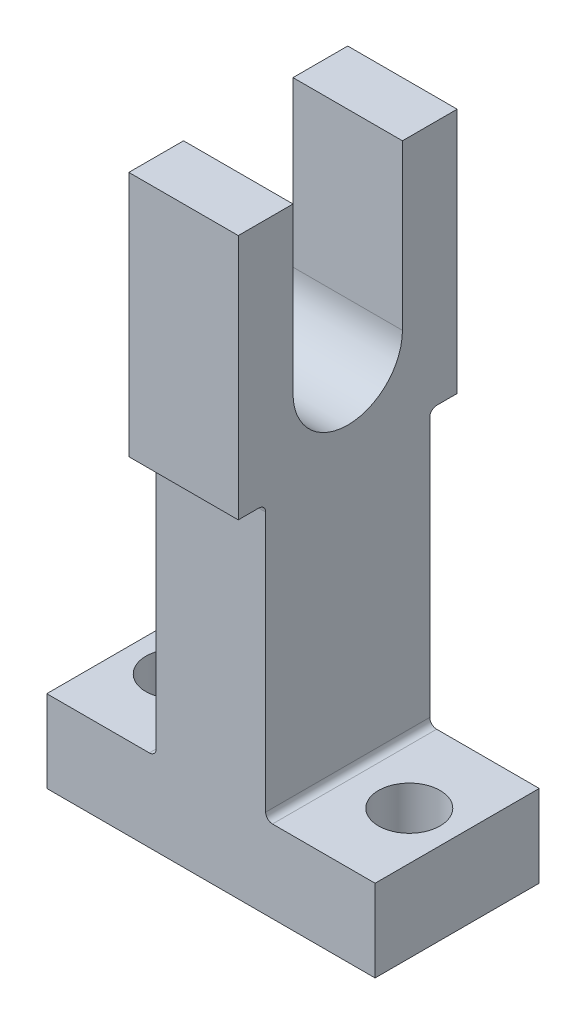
ISO-10303-21;
HEADER;
FILE_DESCRIPTION(('STEP AP214'),'2;1');
FILE_NAME('part.step','',(''),(''),'','','');
FILE_SCHEMA(('AUTOMOTIVE_DESIGN { 1 0 10303 214 1 1 1 1 }'));
ENDSEC;
DATA;
#1=APPLICATION_CONTEXT('core data for automotive mechanical design processes');
#2=APPLICATION_PROTOCOL_DEFINITION('international standard','automotive_design',2000,#1);
#3=PRODUCT_CONTEXT('',#1,'mechanical');
#4=PRODUCT('Part','Part','',(#3));
#5=PRODUCT_RELATED_PRODUCT_CATEGORY('part','',(#4));
#6=PRODUCT_DEFINITION_FORMATION('','',#4);
#7=PRODUCT_DEFINITION_CONTEXT('part definition',#1,'design');
#8=PRODUCT_DEFINITION('design','',#6,#7);
#9=PRODUCT_DEFINITION_SHAPE('','',#8);
#10=(LENGTH_UNIT() NAMED_UNIT(*) SI_UNIT(.MILLI.,.METRE.));
#11=(NAMED_UNIT(*) PLANE_ANGLE_UNIT() SI_UNIT($,.RADIAN.));
#12=(NAMED_UNIT(*) SI_UNIT($,.STERADIAN.) SOLID_ANGLE_UNIT());
#13=UNCERTAINTY_MEASURE_WITH_UNIT(LENGTH_MEASURE(1.E-05),#10,'distance_accuracy_value','');
#14=(GEOMETRIC_REPRESENTATION_CONTEXT(3) GLOBAL_UNCERTAINTY_ASSIGNED_CONTEXT((#13)) GLOBAL_UNIT_ASSIGNED_CONTEXT((#10,
#11,#12)) REPRESENTATION_CONTEXT('',''));
#15=CARTESIAN_POINT('',(0.,0.,0.));
#16=DIRECTION('',(0.,0.,1.));
#17=DIRECTION('',(1.,0.,0.));
#18=AXIS2_PLACEMENT_3D('',#15,#16,#17);
#19=CARTESIAN_POINT('',(-225.289340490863,21.,12.));
#20=DIRECTION('',(0.,-1.,0.));
#21=DIRECTION('',(1.,0.,0.));
#22=AXIS2_PLACEMENT_3D('',#19,#20,#21);
#23=PLANE('',#22);
#24=DIRECTION('',(0.,0.,-1.));
#25=VECTOR('',#24,1.);
#26=CARTESIAN_POINT('',(-217.289340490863,21.,12.));
#27=LINE('',#26,#25);
#28=CARTESIAN_POINT('',(-217.289340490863,21.,14.));
#29=VERTEX_POINT('',#28);
#30=CARTESIAN_POINT('',(-217.289340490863,21.,10.));
#31=VERTEX_POINT('',#30);
#32=EDGE_CURVE('E179',#29,#31,#27,.T.);
#33=ORIENTED_EDGE('',*,*,#32,.T.);
#34=DIRECTION('',(-1.,0.,0.));
#35=VECTOR('',#34,1.);
#36=CARTESIAN_POINT('',(-209.289340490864,21.,10.));
#37=LINE('',#36,#35);
#38=CARTESIAN_POINT('',(-225.289340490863,21.,10.));
#39=VERTEX_POINT('',#38);
#40=EDGE_CURVE('E220',#31,#39,#37,.T.);
#41=ORIENTED_EDGE('',*,*,#40,.T.);
#42=DIRECTION('',(0.,0.,-1.));
#43=VECTOR('',#42,1.);
#44=CARTESIAN_POINT('',(-225.289340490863,21.,12.));
#45=LINE('',#44,#43);
#46=CARTESIAN_POINT('',(-225.289340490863,21.,14.));
#47=VERTEX_POINT('',#46);
#48=EDGE_CURVE('E305',#47,#39,#45,.T.);
#49=ORIENTED_EDGE('',*,*,#48,.F.);
#50=DIRECTION('',(-1.,0.,0.));
#51=VECTOR('',#50,1.);
#52=CARTESIAN_POINT('',(-217.289340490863,21.,14.));
#53=LINE('',#52,#51);
#54=EDGE_CURVE('E173',#29,#47,#53,.T.);
#55=ORIENTED_EDGE('',*,*,#54,.F.);
#56=EDGE_LOOP('',(#33,#41,#49,#55));
#57=FACE_BOUND('',#56,.T.);
#58=ADVANCED_FACE('F16',(#57),#23,.F.);
#59=CARTESIAN_POINT('',(-233.289340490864,-23.,12.));
#60=DIRECTION('',(1.,0.,0.));
#61=DIRECTION('',(0.,0.,-1.));
#62=AXIS2_PLACEMENT_3D('',#59,#60,#61);
#63=PLANE('',#62);
#64=DIRECTION('',(0.,-1.,0.));
#65=VECTOR('',#64,1.);
#66=CARTESIAN_POINT('',(-233.289340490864,-23.,0.));
#67=LINE('',#66,#65);
#68=CARTESIAN_POINT('',(-233.289340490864,-17.,0.));
#69=VERTEX_POINT('',#68);
#70=CARTESIAN_POINT('',(-233.289340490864,-23.,0.));
#71=VERTEX_POINT('',#70);
#72=EDGE_CURVE('E236',#69,#71,#67,.T.);
#73=ORIENTED_EDGE('',*,*,#72,.T.);
#74=DIRECTION('',(0.,0.,-1.));
#75=VECTOR('',#74,1.);
#76=CARTESIAN_POINT('',(-233.289340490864,-23.,12.));
#77=LINE('',#76,#75);
#78=CARTESIAN_POINT('',(-233.289340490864,-23.,12.));
#79=VERTEX_POINT('',#78);
#80=EDGE_CURVE('E294',#79,#71,#77,.T.);
#81=ORIENTED_EDGE('',*,*,#80,.F.);
#82=DIRECTION('',(0.,-1.,0.));
#83=VECTOR('',#82,1.);
#84=CARTESIAN_POINT('',(-233.289340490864,-23.,12.));
#85=LINE('',#84,#83);
#86=CARTESIAN_POINT('',(-233.289340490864,-17.,12.));
#87=VERTEX_POINT('',#86);
#88=EDGE_CURVE('E237',#87,#79,#85,.T.);
#89=ORIENTED_EDGE('',*,*,#88,.F.);
#90=DIRECTION('',(0.,0.,-1.));
#91=VECTOR('',#90,1.);
#92=CARTESIAN_POINT('',(-233.289340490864,-17.,12.));
#93=LINE('',#92,#91);
#94=EDGE_CURVE('E308',#87,#69,#93,.T.);
#95=ORIENTED_EDGE('',*,*,#94,.T.);
#96=EDGE_LOOP('',(#73,#81,#89,#95));
#97=FACE_BOUND('',#96,.T.);
#98=ADVANCED_FACE('F370',(#97),#63,.F.);
#99=CARTESIAN_POINT('',(-233.289340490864,-23.,12.));
#100=DIRECTION('',(0.,1.,0.));
#101=DIRECTION('',(0.,0.,1.));
#102=AXIS2_PLACEMENT_3D('',#99,#100,#101);
#103=PLANE('',#102);
#104=CARTESIAN_POINT('',(-229.789340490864,-23.,6.));
#105=DIRECTION('',(0.,1.,0.));
#106=DIRECTION('',(0.,0.,1.));
#107=AXIS2_PLACEMENT_3D('',#104,#105,#106);
#108=CIRCLE('',#107,2.25);
#109=CARTESIAN_POINT('',(-229.789340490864,-23.,8.25));
#110=VERTEX_POINT('',#109);
#111=EDGE_CURVE('E202',#110,#110,#108,.T.);
#112=ORIENTED_EDGE('',*,*,#111,.T.);
#113=EDGE_LOOP('',(#112));
#114=FACE_BOUND('',#113,.T.);
#115=CARTESIAN_POINT('',(-212.789340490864,-23.,6.));
#116=DIRECTION('',(0.,1.,0.));
#117=DIRECTION('',(0.,0.,1.));
#118=AXIS2_PLACEMENT_3D('',#115,#116,#117);
#119=CIRCLE('',#118,2.25);
#120=CARTESIAN_POINT('',(-212.789340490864,-23.,8.25));
#121=VERTEX_POINT('',#120);
#122=EDGE_CURVE('E208',#121,#121,#119,.T.);
#123=ORIENTED_EDGE('',*,*,#122,.T.);
#124=EDGE_LOOP('',(#123));
#125=FACE_BOUND('',#124,.T.);
#126=DIRECTION('',(1.,0.,0.));
#127=VECTOR('',#126,1.);
#128=CARTESIAN_POINT('',(-233.289340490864,-23.,0.));
#129=LINE('',#128,#127);
#130=CARTESIAN_POINT('',(-209.289340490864,-23.,0.));
#131=VERTEX_POINT('',#130);
#132=EDGE_CURVE('E319',#71,#131,#129,.T.);
#133=ORIENTED_EDGE('',*,*,#132,.T.);
#134=DIRECTION('',(0.,0.,-1.));
#135=VECTOR('',#134,1.);
#136=CARTESIAN_POINT('',(-209.289340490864,-23.,12.));
#137=LINE('',#136,#135);
#138=CARTESIAN_POINT('',(-209.289340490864,-23.,12.));
#139=VERTEX_POINT('',#138);
#140=EDGE_CURVE('E297',#139,#131,#137,.T.);
#141=ORIENTED_EDGE('',*,*,#140,.F.);
#142=DIRECTION('',(1.,0.,0.));
#143=VECTOR('',#142,1.);
#144=CARTESIAN_POINT('',(-233.289340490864,-23.,12.));
#145=LINE('',#144,#143);
#146=EDGE_CURVE('E240',#79,#139,#145,.T.);
#147=ORIENTED_EDGE('',*,*,#146,.F.);
#148=ORIENTED_EDGE('',*,*,#80,.T.);
#149=EDGE_LOOP('',(#133,#141,#147,#148));
#150=FACE_BOUND('',#149,.T.);
#151=ADVANCED_FACE('F360',(#114,#125,#150),#103,.F.);
#152=CARTESIAN_POINT('',(-209.289340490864,-23.,12.));
#153=DIRECTION('',(-1.,0.,0.));
#154=DIRECTION('',(0.,0.,1.));
#155=AXIS2_PLACEMENT_3D('',#152,#153,#154);
#156=PLANE('',#155);
#157=DIRECTION('',(0.,1.,0.));
#158=VECTOR('',#157,1.);
#159=CARTESIAN_POINT('',(-209.289340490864,-23.,0.));
#160=LINE('',#159,#158);
#161=CARTESIAN_POINT('',(-209.289340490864,-17.,0.));
#162=VERTEX_POINT('',#161);
#163=EDGE_CURVE('E320',#131,#162,#160,.T.);
#164=ORIENTED_EDGE('',*,*,#163,.T.);
#165=DIRECTION('',(0.,0.,-1.));
#166=VECTOR('',#165,1.);
#167=CARTESIAN_POINT('',(-209.289340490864,-17.,12.));
#168=LINE('',#167,#166);
#169=CARTESIAN_POINT('',(-209.289340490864,-17.,12.));
#170=VERTEX_POINT('',#169);
#171=EDGE_CURVE('E300',#170,#162,#168,.T.);
#172=ORIENTED_EDGE('',*,*,#171,.F.);
#173=DIRECTION('',(0.,1.,0.));
#174=VECTOR('',#173,1.);
#175=CARTESIAN_POINT('',(-209.289340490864,-23.,12.));
#176=LINE('',#175,#174);
#177=EDGE_CURVE('E243',#139,#170,#176,.T.);
#178=ORIENTED_EDGE('',*,*,#177,.F.);
#179=ORIENTED_EDGE('',*,*,#140,.T.);
#180=EDGE_LOOP('',(#164,#172,#178,#179));
#181=FACE_BOUND('',#180,.T.);
#182=ADVANCED_FACE('F358',(#181),#156,.F.);
#183=CARTESIAN_POINT('',(-217.289340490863,-17.,12.));
#184=DIRECTION('',(0.,-1.,0.));
#185=DIRECTION('',(0.,0.,-1.));
#186=AXIS2_PLACEMENT_3D('',#183,#184,#185);
#187=PLANE('',#186);
#188=CARTESIAN_POINT('',(-212.789340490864,-17.,6.));
#189=DIRECTION('',(0.,1.,0.));
#190=DIRECTION('',(0.,0.,1.));
#191=AXIS2_PLACEMENT_3D('',#188,#189,#190);
#192=CIRCLE('',#191,2.25);
#193=CARTESIAN_POINT('',(-212.789340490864,-17.,8.25));
#194=VERTEX_POINT('',#193);
#195=EDGE_CURVE('E205',#194,#194,#192,.T.);
#196=ORIENTED_EDGE('',*,*,#195,.F.);
#197=EDGE_LOOP('',(#196));
#198=FACE_BOUND('',#197,.T.);
#199=DIRECTION('',(-1.,0.,0.));
#200=VECTOR('',#199,1.);
#201=CARTESIAN_POINT('',(-217.289340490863,-17.,0.));
#202=LINE('',#201,#200);
#203=CARTESIAN_POINT('',(-216.789340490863,-17.,0.));
#204=VERTEX_POINT('',#203);
#205=EDGE_CURVE('E263',#162,#204,#202,.T.);
#206=ORIENTED_EDGE('',*,*,#205,.T.);
#207=DIRECTION('',(0.,0.,-1.));
#208=VECTOR('',#207,1.);
#209=CARTESIAN_POINT('',(-216.789340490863,-17.,12.));
#210=LINE('',#209,#208);
#211=CARTESIAN_POINT('',(-216.789340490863,-17.,12.));
#212=VERTEX_POINT('',#211);
#213=EDGE_CURVE('E31',#204,#212,#210,.F.);
#214=ORIENTED_EDGE('',*,*,#213,.T.);
#215=DIRECTION('',(-1.,0.,0.));
#216=VECTOR('',#215,1.);
#217=CARTESIAN_POINT('',(-217.289340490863,-17.,12.));
#218=LINE('',#217,#216);
#219=EDGE_CURVE('E245',#170,#212,#218,.T.);
#220=ORIENTED_EDGE('',*,*,#219,.F.);
#221=ORIENTED_EDGE('',*,*,#171,.T.);
#222=EDGE_LOOP('',(#206,#214,#220,#221));
#223=FACE_BOUND('',#222,.T.);
#224=ADVANCED_FACE('F324',(#198,#223),#187,.F.);
#225=CARTESIAN_POINT('',(-217.289340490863,-17.,12.));
#226=DIRECTION('',(-1.,0.,0.));
#227=DIRECTION('',(0.,0.,1.));
#228=AXIS2_PLACEMENT_3D('',#225,#226,#227);
#229=PLANE('',#228);
#230=DIRECTION('',(0.,1.,0.));
#231=VECTOR('',#230,1.);
#232=CARTESIAN_POINT('',(-217.289340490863,-17.,12.));
#233=LINE('',#232,#231);
#234=CARTESIAN_POINT('',(-217.289340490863,-16.5,12.));
#235=VERTEX_POINT('',#234);
#236=CARTESIAN_POINT('',(-217.289340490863,2.5,12.));
#237=VERTEX_POINT('',#236);
#238=EDGE_CURVE('E247',#235,#237,#233,.T.);
#239=ORIENTED_EDGE('',*,*,#238,.F.);
#240=DIRECTION('',(0.,0.,-1.));
#241=VECTOR('',#240,1.);
#242=CARTESIAN_POINT('',(-217.289340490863,-16.5,0.));
#243=LINE('',#242,#241);
#244=CARTESIAN_POINT('',(-217.289340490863,-16.5,0.));
#245=VERTEX_POINT('',#244);
#246=EDGE_CURVE('E264',#235,#245,#243,.T.);
#247=ORIENTED_EDGE('',*,*,#246,.T.);
#248=DIRECTION('',(0.,1.,0.));
#249=VECTOR('',#248,1.);
#250=CARTESIAN_POINT('',(-217.289340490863,-17.,0.));
#251=LINE('',#250,#249);
#252=CARTESIAN_POINT('',(-217.289340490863,2.5,0.));
#253=VERTEX_POINT('',#252);
#254=EDGE_CURVE('E258',#245,#253,#251,.T.);
#255=ORIENTED_EDGE('',*,*,#254,.T.);
#256=CARTESIAN_POINT('',(-217.289340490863,2.5,-0.5));
#257=DIRECTION('',(-1.,0.,0.));
#258=DIRECTION('',(0.,0.,1.));
#259=AXIS2_PLACEMENT_3D('',#256,#257,#258);
#260=CIRCLE('',#259,0.5);
#261=CARTESIAN_POINT('',(-217.289340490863,3.,-0.5));
#262=VERTEX_POINT('',#261);
#263=EDGE_CURVE('E349',#253,#262,#260,.T.);
#264=ORIENTED_EDGE('',*,*,#263,.T.);
#265=DIRECTION('',(0.,0.,1.));
#266=VECTOR('',#265,1.);
#267=CARTESIAN_POINT('',(-217.289340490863,3.,0.));
#268=LINE('',#267,#266);
#269=CARTESIAN_POINT('',(-217.289340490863,3.,-2.));
#270=VERTEX_POINT('',#269);
#271=EDGE_CURVE('E190',#270,#262,#268,.T.);
#272=ORIENTED_EDGE('',*,*,#271,.F.);
#273=DIRECTION('',(0.,-1.,0.));
#274=VECTOR('',#273,1.);
#275=CARTESIAN_POINT('',(-217.289340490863,21.,-2.));
#276=LINE('',#275,#274);
#277=CARTESIAN_POINT('',(-217.289340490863,21.,-2.));
#278=VERTEX_POINT('',#277);
#279=EDGE_CURVE('E187',#278,#270,#276,.T.);
#280=ORIENTED_EDGE('',*,*,#279,.F.);
#281=CARTESIAN_POINT('',(-217.289340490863,21.,2.));
#282=VERTEX_POINT('',#281);
#283=EDGE_CURVE('E304',#282,#278,#27,.T.);
#284=ORIENTED_EDGE('',*,*,#283,.F.);
#285=DIRECTION('',(0.,-1.,0.));
#286=VECTOR('',#285,1.);
#287=CARTESIAN_POINT('',(-217.289340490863,-17.,2.));
#288=LINE('',#287,#286);
#289=CARTESIAN_POINT('',(-217.289340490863,9.,2.));
#290=VERTEX_POINT('',#289);
#291=EDGE_CURVE('E223',#282,#290,#288,.T.);
#292=ORIENTED_EDGE('',*,*,#291,.T.);
#293=CARTESIAN_POINT('',(-217.289340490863,9.,6.));
#294=DIRECTION('',(-1.,0.,0.));
#295=DIRECTION('',(0.,0.,1.));
#296=AXIS2_PLACEMENT_3D('',#293,#294,#295);
#297=CIRCLE('',#296,4.);
#298=CARTESIAN_POINT('',(-217.289340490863,9.,10.));
#299=VERTEX_POINT('',#298);
#300=EDGE_CURVE('E231',#290,#299,#297,.T.);
#301=ORIENTED_EDGE('',*,*,#300,.T.);
#302=DIRECTION('',(0.,1.,0.));
#303=VECTOR('',#302,1.);
#304=CARTESIAN_POINT('',(-217.289340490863,-17.,10.));
#305=LINE('',#304,#303);
#306=EDGE_CURVE('E234',#299,#31,#305,.T.);
#307=ORIENTED_EDGE('',*,*,#306,.T.);
#308=ORIENTED_EDGE('',*,*,#32,.F.);
#309=DIRECTION('',(0.,1.,0.));
#310=VECTOR('',#309,1.);
#311=CARTESIAN_POINT('',(-217.289340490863,21.,14.));
#312=LINE('',#311,#310);
#313=CARTESIAN_POINT('',(-217.289340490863,3.,14.));
#314=VERTEX_POINT('',#313);
#315=EDGE_CURVE('E165',#314,#29,#312,.T.);
#316=ORIENTED_EDGE('',*,*,#315,.F.);
#317=DIRECTION('',(0.,0.,1.));
#318=VECTOR('',#317,1.);
#319=CARTESIAN_POINT('',(-217.289340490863,3.,12.));
#320=LINE('',#319,#318);
#321=CARTESIAN_POINT('',(-217.289340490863,3.,12.5));
#322=VERTEX_POINT('',#321);
#323=EDGE_CURVE('E154',#322,#314,#320,.T.);
#324=ORIENTED_EDGE('',*,*,#323,.F.);
#325=CARTESIAN_POINT('',(-217.289340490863,2.5,12.5));
#326=DIRECTION('',(-1.,0.,0.));
#327=DIRECTION('',(0.,0.,1.));
#328=AXIS2_PLACEMENT_3D('',#325,#326,#327);
#329=CIRCLE('',#328,0.5);
#330=EDGE_CURVE('E11',#322,#237,#329,.T.);
#331=ORIENTED_EDGE('',*,*,#330,.T.);
#332=EDGE_LOOP('',(#239,#247,#255,#264,#272,#280,#284,#292,#301,#307,#308,#316,#324,#331));
#333=FACE_BOUND('',#332,.T.);
#334=ADVANCED_FACE('F176',(#333),#229,.F.);
#335=CARTESIAN_POINT('',(-225.289340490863,21.,2.));
#336=VERTEX_POINT('',#335);
#337=CARTESIAN_POINT('',(-225.289340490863,21.,-2.));
#338=VERTEX_POINT('',#337);
#339=EDGE_CURVE('E307',#336,#338,#45,.T.);
#340=ORIENTED_EDGE('',*,*,#339,.F.);
#341=DIRECTION('',(-1.,0.,0.));
#342=VECTOR('',#341,1.);
#343=CARTESIAN_POINT('',(-209.289340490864,21.,2.));
#344=LINE('',#343,#342);
#345=EDGE_CURVE('E219',#282,#336,#344,.T.);
#346=ORIENTED_EDGE('',*,*,#345,.F.);
#347=ORIENTED_EDGE('',*,*,#283,.T.);
#348=DIRECTION('',(-1.,0.,0.));
#349=VECTOR('',#348,1.);
#350=CARTESIAN_POINT('',(-217.289340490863,21.,-2.));
#351=LINE('',#350,#349);
#352=EDGE_CURVE('E197',#278,#338,#351,.T.);
#353=ORIENTED_EDGE('',*,*,#352,.T.);
#354=EDGE_LOOP('',(#340,#346,#347,#353));
#355=FACE_BOUND('',#354,.T.);
#356=ADVANCED_FACE('F376',(#355),#23,.F.);
#357=CARTESIAN_POINT('',(-225.289340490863,-17.,12.));
#358=DIRECTION('',(1.,0.,0.));
#359=DIRECTION('',(0.,0.,-1.));
#360=AXIS2_PLACEMENT_3D('',#357,#358,#359);
#361=PLANE('',#360);
#362=DIRECTION('',(0.,-1.,0.));
#363=VECTOR('',#362,1.);
#364=CARTESIAN_POINT('',(-225.289340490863,-17.,0.));
#365=LINE('',#364,#363);
#366=CARTESIAN_POINT('',(-225.289340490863,2.5,0.));
#367=VERTEX_POINT('',#366);
#368=CARTESIAN_POINT('',(-225.289340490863,-16.5,0.));
#369=VERTEX_POINT('',#368);
#370=EDGE_CURVE('E262',#367,#369,#365,.T.);
#371=ORIENTED_EDGE('',*,*,#370,.T.);
#372=DIRECTION('',(0.,0.,-1.));
#373=VECTOR('',#372,1.);
#374=CARTESIAN_POINT('',(-225.289340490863,-16.5,12.));
#375=LINE('',#374,#373);
#376=CARTESIAN_POINT('',(-225.289340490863,-16.5,12.));
#377=VERTEX_POINT('',#376);
#378=EDGE_CURVE('E282',#369,#377,#375,.F.);
#379=ORIENTED_EDGE('',*,*,#378,.T.);
#380=DIRECTION('',(0.,-1.,0.));
#381=VECTOR('',#380,1.);
#382=CARTESIAN_POINT('',(-225.289340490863,-17.,12.));
#383=LINE('',#382,#381);
#384=CARTESIAN_POINT('',(-225.289340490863,2.5,12.));
#385=VERTEX_POINT('',#384);
#386=EDGE_CURVE('E255',#385,#377,#383,.T.);
#387=ORIENTED_EDGE('',*,*,#386,.F.);
#388=CARTESIAN_POINT('',(-225.289340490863,2.5,12.5));
#389=DIRECTION('',(1.,0.,0.));
#390=DIRECTION('',(0.,0.,-1.));
#391=AXIS2_PLACEMENT_3D('',#388,#389,#390);
#392=CIRCLE('',#391,0.5);
#393=CARTESIAN_POINT('',(-225.289340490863,3.,12.5));
#394=VERTEX_POINT('',#393);
#395=EDGE_CURVE('E24',#385,#394,#392,.T.);
#396=ORIENTED_EDGE('',*,*,#395,.T.);
#397=DIRECTION('',(0.,0.,1.));
#398=VECTOR('',#397,1.);
#399=CARTESIAN_POINT('',(-225.289340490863,3.,12.));
#400=LINE('',#399,#398);
#401=CARTESIAN_POINT('',(-225.289340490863,3.,14.));
#402=VERTEX_POINT('',#401);
#403=EDGE_CURVE('E184',#394,#402,#400,.T.);
#404=ORIENTED_EDGE('',*,*,#403,.T.);
#405=DIRECTION('',(0.,1.,0.));
#406=VECTOR('',#405,1.);
#407=CARTESIAN_POINT('',(-225.289340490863,21.,14.));
#408=LINE('',#407,#406);
#409=EDGE_CURVE('E166',#402,#47,#408,.T.);
#410=ORIENTED_EDGE('',*,*,#409,.T.);
#411=ORIENTED_EDGE('',*,*,#48,.T.);
#412=DIRECTION('',(0.,1.,0.));
#413=VECTOR('',#412,1.);
#414=CARTESIAN_POINT('',(-225.289340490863,21.,10.));
#415=LINE('',#414,#413);
#416=CARTESIAN_POINT('',(-225.289340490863,9.,10.));
#417=VERTEX_POINT('',#416);
#418=EDGE_CURVE('E217',#417,#39,#415,.T.);
#419=ORIENTED_EDGE('',*,*,#418,.F.);
#420=CARTESIAN_POINT('',(-225.289340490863,9.,6.));
#421=DIRECTION('',(-1.,0.,0.));
#422=DIRECTION('',(0.,0.,1.));
#423=AXIS2_PLACEMENT_3D('',#420,#421,#422);
#424=CIRCLE('',#423,4.);
#425=CARTESIAN_POINT('',(-225.289340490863,9.,2.));
#426=VERTEX_POINT('',#425);
#427=EDGE_CURVE('E214',#426,#417,#424,.T.);
#428=ORIENTED_EDGE('',*,*,#427,.F.);
#429=DIRECTION('',(0.,-1.,0.));
#430=VECTOR('',#429,1.);
#431=CARTESIAN_POINT('',(-225.289340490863,21.,2.));
#432=LINE('',#431,#430);
#433=EDGE_CURVE('E211',#336,#426,#432,.T.);
#434=ORIENTED_EDGE('',*,*,#433,.F.);
#435=ORIENTED_EDGE('',*,*,#339,.T.);
#436=DIRECTION('',(0.,-1.,0.));
#437=VECTOR('',#436,1.);
#438=CARTESIAN_POINT('',(-225.289340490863,21.,-2.));
#439=LINE('',#438,#437);
#440=CARTESIAN_POINT('',(-225.289340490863,3.,-2.));
#441=VERTEX_POINT('',#440);
#442=EDGE_CURVE('E185',#338,#441,#439,.T.);
#443=ORIENTED_EDGE('',*,*,#442,.T.);
#444=DIRECTION('',(0.,0.,1.));
#445=VECTOR('',#444,1.);
#446=CARTESIAN_POINT('',(-225.289340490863,3.,0.));
#447=LINE('',#446,#445);
#448=CARTESIAN_POINT('',(-225.289340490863,3.,-0.5));
#449=VERTEX_POINT('',#448);
#450=EDGE_CURVE('E191',#441,#449,#447,.T.);
#451=ORIENTED_EDGE('',*,*,#450,.T.);
#452=CARTESIAN_POINT('',(-225.289340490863,2.5,-0.5));
#453=DIRECTION('',(1.,0.,0.));
#454=DIRECTION('',(0.,0.,-1.));
#455=AXIS2_PLACEMENT_3D('',#452,#453,#454);
#456=CIRCLE('',#455,0.5);
#457=EDGE_CURVE('E347',#449,#367,#456,.T.);
#458=ORIENTED_EDGE('',*,*,#457,.T.);
#459=EDGE_LOOP('',(#371,#379,#387,#396,#404,#410,#411,#419,#428,#434,#435,#443,#451,#458));
#460=FACE_BOUND('',#459,.T.);
#461=ADVANCED_FACE('F352',(#460),#361,.F.);
#462=CARTESIAN_POINT('',(-233.289340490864,-17.,12.));
#463=DIRECTION('',(0.,-1.,0.));
#464=DIRECTION('',(0.,0.,-1.));
#465=AXIS2_PLACEMENT_3D('',#462,#463,#464);
#466=PLANE('',#465);
#467=CARTESIAN_POINT('',(-229.789340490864,-17.,6.));
#468=DIRECTION('',(0.,1.,0.));
#469=DIRECTION('',(0.,0.,1.));
#470=AXIS2_PLACEMENT_3D('',#467,#468,#469);
#471=CIRCLE('',#470,2.25);
#472=CARTESIAN_POINT('',(-229.789340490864,-17.,8.25));
#473=VERTEX_POINT('',#472);
#474=EDGE_CURVE('E196',#473,#473,#471,.T.);
#475=ORIENTED_EDGE('',*,*,#474,.F.);
#476=EDGE_LOOP('',(#475));
#477=FACE_BOUND('',#476,.T.);
#478=DIRECTION('',(-1.,0.,0.));
#479=VECTOR('',#478,1.);
#480=CARTESIAN_POINT('',(-233.289340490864,-17.,12.));
#481=LINE('',#480,#479);
#482=CARTESIAN_POINT('',(-225.789340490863,-17.,12.));
#483=VERTEX_POINT('',#482);
#484=EDGE_CURVE('E280',#483,#87,#481,.T.);
#485=ORIENTED_EDGE('',*,*,#484,.F.);
#486=DIRECTION('',(0.,0.,-1.));
#487=VECTOR('',#486,1.);
#488=CARTESIAN_POINT('',(-225.789340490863,-17.,0.));
#489=LINE('',#488,#487);
#490=CARTESIAN_POINT('',(-225.789340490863,-17.,0.));
#491=VERTEX_POINT('',#490);
#492=EDGE_CURVE('E277',#483,#491,#489,.T.);
#493=ORIENTED_EDGE('',*,*,#492,.T.);
#494=DIRECTION('',(-1.,0.,0.));
#495=VECTOR('',#494,1.);
#496=CARTESIAN_POINT('',(-233.289340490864,-17.,0.));
#497=LINE('',#496,#495);
#498=EDGE_CURVE('E241',#491,#69,#497,.T.);
#499=ORIENTED_EDGE('',*,*,#498,.T.);
#500=ORIENTED_EDGE('',*,*,#94,.F.);
#501=EDGE_LOOP('',(#485,#493,#499,#500));
#502=FACE_BOUND('',#501,.T.);
#503=ADVANCED_FACE('F391',(#477,#502),#466,.F.);
#504=CARTESIAN_POINT('',(0.,0.,12.));
#505=DIRECTION('',(0.,0.,-1.));
#506=DIRECTION('',(-1.,0.,0.));
#507=AXIS2_PLACEMENT_3D('',#504,#505,#506);
#508=PLANE('',#507);
#509=ORIENTED_EDGE('',*,*,#238,.T.);
#510=DIRECTION('',(-1.,0.,0.));
#511=VECTOR('',#510,1.);
#512=CARTESIAN_POINT('',(0.,2.5,12.));
#513=LINE('',#512,#511);
#514=EDGE_CURVE('E337',#237,#385,#513,.T.);
#515=ORIENTED_EDGE('',*,*,#514,.T.);
#516=ORIENTED_EDGE('',*,*,#386,.T.);
#517=CARTESIAN_POINT('',(-225.789340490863,-16.5,12.));
#518=DIRECTION('',(0.,0.,-1.));
#519=DIRECTION('',(-1.,0.,0.));
#520=AXIS2_PLACEMENT_3D('',#517,#518,#519);
#521=CIRCLE('',#520,0.5);
#522=EDGE_CURVE('E343',#377,#483,#521,.T.);
#523=ORIENTED_EDGE('',*,*,#522,.T.);
#524=ORIENTED_EDGE('',*,*,#484,.T.);
#525=ORIENTED_EDGE('',*,*,#88,.T.);
#526=ORIENTED_EDGE('',*,*,#146,.T.);
#527=ORIENTED_EDGE('',*,*,#177,.T.);
#528=ORIENTED_EDGE('',*,*,#219,.T.);
#529=CARTESIAN_POINT('',(-216.789340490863,-16.5,12.));
#530=DIRECTION('',(0.,0.,-1.));
#531=DIRECTION('',(-1.,0.,0.));
#532=AXIS2_PLACEMENT_3D('',#529,#530,#531);
#533=CIRCLE('',#532,0.5);
#534=EDGE_CURVE('E330',#212,#235,#533,.T.);
#535=ORIENTED_EDGE('',*,*,#534,.T.);
#536=EDGE_LOOP('',(#509,#515,#516,#523,#524,#525,#526,#527,#528,#535));
#537=FACE_BOUND('',#536,.T.);
#538=ADVANCED_FACE('F355',(#537),#508,.F.);
#539=CARTESIAN_POINT('',(0.,0.,0.));
#540=DIRECTION('',(0.,0.,-1.));
#541=DIRECTION('',(-1.,0.,0.));
#542=AXIS2_PLACEMENT_3D('',#539,#540,#541);
#543=PLANE('',#542);
#544=ORIENTED_EDGE('',*,*,#370,.F.);
#545=DIRECTION('',(-1.,0.,0.));
#546=VECTOR('',#545,1.);
#547=CARTESIAN_POINT('',(-217.289340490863,2.5,0.));
#548=LINE('',#547,#546);
#549=EDGE_CURVE('E333',#367,#253,#548,.F.);
#550=ORIENTED_EDGE('',*,*,#549,.T.);
#551=ORIENTED_EDGE('',*,*,#254,.F.);
#552=CARTESIAN_POINT('',(-216.789340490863,-16.5,0.));
#553=DIRECTION('',(0.,0.,-1.));
#554=DIRECTION('',(-1.,0.,0.));
#555=AXIS2_PLACEMENT_3D('',#552,#553,#554);
#556=CIRCLE('',#555,0.5);
#557=EDGE_CURVE('E39',#245,#204,#556,.F.);
#558=ORIENTED_EDGE('',*,*,#557,.T.);
#559=ORIENTED_EDGE('',*,*,#205,.F.);
#560=ORIENTED_EDGE('',*,*,#163,.F.);
#561=ORIENTED_EDGE('',*,*,#132,.F.);
#562=ORIENTED_EDGE('',*,*,#72,.F.);
#563=ORIENTED_EDGE('',*,*,#498,.F.);
#564=CARTESIAN_POINT('',(-225.789340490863,-16.5,0.));
#565=DIRECTION('',(0.,0.,-1.));
#566=DIRECTION('',(-1.,0.,0.));
#567=AXIS2_PLACEMENT_3D('',#564,#565,#566);
#568=CIRCLE('',#567,0.5);
#569=EDGE_CURVE('E341',#491,#369,#568,.F.);
#570=ORIENTED_EDGE('',*,*,#569,.T.);
#571=EDGE_LOOP('',(#544,#550,#551,#558,#559,#560,#561,#562,#563,#570));
#572=FACE_BOUND('',#571,.T.);
#573=ADVANCED_FACE('F415',(#572),#543,.T.);
#574=CARTESIAN_POINT('',(-209.289340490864,21.,10.));
#575=DIRECTION('',(0.,0.,1.));
#576=DIRECTION('',(1.,0.,0.));
#577=AXIS2_PLACEMENT_3D('',#574,#575,#576);
#578=PLANE('',#577);
#579=DIRECTION('',(-1.,0.,0.));
#580=VECTOR('',#579,1.);
#581=CARTESIAN_POINT('',(-209.289340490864,9.,10.));
#582=LINE('',#581,#580);
#583=EDGE_CURVE('E224',#299,#417,#582,.T.);
#584=ORIENTED_EDGE('',*,*,#583,.T.);
#585=ORIENTED_EDGE('',*,*,#418,.T.);
#586=ORIENTED_EDGE('',*,*,#40,.F.);
#587=ORIENTED_EDGE('',*,*,#306,.F.);
#588=EDGE_LOOP('',(#584,#585,#586,#587));
#589=FACE_BOUND('',#588,.T.);
#590=ADVANCED_FACE('F452',(#589),#578,.F.);
#591=CARTESIAN_POINT('',(-209.289340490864,9.,6.));
#592=DIRECTION('',(-1.,0.,0.));
#593=DIRECTION('',(0.,0.,1.));
#594=AXIS2_PLACEMENT_3D('',#591,#592,#593);
#595=CYLINDRICAL_SURFACE('',#594,4.);
#596=DIRECTION('',(-1.,0.,0.));
#597=VECTOR('',#596,1.);
#598=CARTESIAN_POINT('',(-209.289340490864,9.,2.));
#599=LINE('',#598,#597);
#600=EDGE_CURVE('E226',#290,#426,#599,.T.);
#601=ORIENTED_EDGE('',*,*,#600,.T.);
#602=ORIENTED_EDGE('',*,*,#427,.T.);
#603=ORIENTED_EDGE('',*,*,#583,.F.);
#604=ORIENTED_EDGE('',*,*,#300,.F.);
#605=EDGE_LOOP('',(#601,#602,#603,#604));
#606=FACE_BOUND('',#605,.T.);
#607=ADVANCED_FACE('F457',(#606),#595,.F.);
#608=CARTESIAN_POINT('',(-209.289340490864,21.,2.));
#609=DIRECTION('',(0.,0.,-1.));
#610=DIRECTION('',(0.,1.,0.));
#611=AXIS2_PLACEMENT_3D('',#608,#609,#610);
#612=PLANE('',#611);
#613=ORIENTED_EDGE('',*,*,#345,.T.);
#614=ORIENTED_EDGE('',*,*,#433,.T.);
#615=ORIENTED_EDGE('',*,*,#600,.F.);
#616=ORIENTED_EDGE('',*,*,#291,.F.);
#617=EDGE_LOOP('',(#613,#614,#615,#616));
#618=FACE_BOUND('',#617,.T.);
#619=ADVANCED_FACE('F403',(#618),#612,.F.);
#620=CARTESIAN_POINT('',(-212.789340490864,-17.,6.));
#621=DIRECTION('',(0.,1.,0.));
#622=DIRECTION('',(0.,0.,1.));
#623=AXIS2_PLACEMENT_3D('',#620,#621,#622);
#624=CYLINDRICAL_SURFACE('',#623,2.25);
#625=ORIENTED_EDGE('',*,*,#122,.F.);
#626=EDGE_LOOP('',(#625));
#627=FACE_BOUND('',#626,.T.);
#628=ORIENTED_EDGE('',*,*,#195,.T.);
#629=EDGE_LOOP('',(#628));
#630=FACE_BOUND('',#629,.T.);
#631=ADVANCED_FACE('F456',(#627,#630),#624,.F.);
#632=CARTESIAN_POINT('',(-229.789340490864,-17.,6.));
#633=DIRECTION('',(0.,1.,0.));
#634=DIRECTION('',(0.,0.,1.));
#635=AXIS2_PLACEMENT_3D('',#632,#633,#634);
#636=CYLINDRICAL_SURFACE('',#635,2.25);
#637=ORIENTED_EDGE('',*,*,#111,.F.);
#638=EDGE_LOOP('',(#637));
#639=FACE_BOUND('',#638,.T.);
#640=ORIENTED_EDGE('',*,*,#474,.T.);
#641=EDGE_LOOP('',(#640));
#642=FACE_BOUND('',#641,.T.);
#643=ADVANCED_FACE('F466',(#639,#642),#636,.F.);
#644=CARTESIAN_POINT('',(-217.289340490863,3.,0.));
#645=DIRECTION('',(0.,-1.,0.));
#646=DIRECTION('',(0.,0.,-1.));
#647=AXIS2_PLACEMENT_3D('',#644,#645,#646);
#648=PLANE('',#647);
#649=ORIENTED_EDGE('',*,*,#271,.T.);
#650=DIRECTION('',(-1.,0.,0.));
#651=VECTOR('',#650,1.);
#652=CARTESIAN_POINT('',(-225.289340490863,3.,-0.5));
#653=LINE('',#652,#651);
#654=EDGE_CURVE('E331',#262,#449,#653,.T.);
#655=ORIENTED_EDGE('',*,*,#654,.T.);
#656=ORIENTED_EDGE('',*,*,#450,.F.);
#657=DIRECTION('',(-1.,0.,0.));
#658=VECTOR('',#657,1.);
#659=CARTESIAN_POINT('',(-217.289340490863,3.,-2.));
#660=LINE('',#659,#658);
#661=EDGE_CURVE('E194',#270,#441,#660,.T.);
#662=ORIENTED_EDGE('',*,*,#661,.F.);
#663=EDGE_LOOP('',(#649,#655,#656,#662));
#664=FACE_BOUND('',#663,.T.);
#665=ADVANCED_FACE('F409',(#664),#648,.T.);
#666=CARTESIAN_POINT('',(-217.289340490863,21.,-2.));
#667=DIRECTION('',(0.,0.,-1.));
#668=DIRECTION('',(0.,1.,0.));
#669=AXIS2_PLACEMENT_3D('',#666,#667,#668);
#670=PLANE('',#669);
#671=ORIENTED_EDGE('',*,*,#442,.F.);
#672=ORIENTED_EDGE('',*,*,#352,.F.);
#673=ORIENTED_EDGE('',*,*,#279,.T.);
#674=ORIENTED_EDGE('',*,*,#661,.T.);
#675=EDGE_LOOP('',(#671,#672,#673,#674));
#676=FACE_BOUND('',#675,.T.);
#677=ADVANCED_FACE('F407',(#676),#670,.T.);
#678=CARTESIAN_POINT('',(-217.289340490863,21.,14.));
#679=DIRECTION('',(0.,0.,1.));
#680=DIRECTION('',(0.,-1.,0.));
#681=AXIS2_PLACEMENT_3D('',#678,#679,#680);
#682=PLANE('',#681);
#683=ORIENTED_EDGE('',*,*,#409,.F.);
#684=DIRECTION('',(-1.,0.,0.));
#685=VECTOR('',#684,1.);
#686=CARTESIAN_POINT('',(-217.289340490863,3.,14.));
#687=LINE('',#686,#685);
#688=EDGE_CURVE('E158',#314,#402,#687,.T.);
#689=ORIENTED_EDGE('',*,*,#688,.F.);
#690=ORIENTED_EDGE('',*,*,#315,.T.);
#691=ORIENTED_EDGE('',*,*,#54,.T.);
#692=EDGE_LOOP('',(#683,#689,#690,#691));
#693=FACE_BOUND('',#692,.T.);
#694=ADVANCED_FACE('F170',(#693),#682,.T.);
#695=CARTESIAN_POINT('',(-217.289340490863,3.,12.));
#696=DIRECTION('',(0.,-1.,0.));
#697=DIRECTION('',(0.,0.,-1.));
#698=AXIS2_PLACEMENT_3D('',#695,#696,#697);
#699=PLANE('',#698);
#700=ORIENTED_EDGE('',*,*,#403,.F.);
#701=DIRECTION('',(-1.,0.,0.));
#702=VECTOR('',#701,1.);
#703=CARTESIAN_POINT('',(-217.289340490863,3.,12.5));
#704=LINE('',#703,#702);
#705=EDGE_CURVE('E161',#394,#322,#704,.F.);
#706=ORIENTED_EDGE('',*,*,#705,.T.);
#707=ORIENTED_EDGE('',*,*,#323,.T.);
#708=ORIENTED_EDGE('',*,*,#688,.T.);
#709=EDGE_LOOP('',(#700,#706,#707,#708));
#710=FACE_BOUND('',#709,.T.);
#711=ADVANCED_FACE('F157',(#710),#699,.T.);
#712=CARTESIAN_POINT('',(-225.789340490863,-16.5,12.));
#713=DIRECTION('',(0.,0.,1.));
#714=DIRECTION('',(1.,0.,0.));
#715=AXIS2_PLACEMENT_3D('',#712,#713,#714);
#716=CYLINDRICAL_SURFACE('',#715,0.5);
#717=ORIENTED_EDGE('',*,*,#522,.F.);
#718=ORIENTED_EDGE('',*,*,#378,.F.);
#719=ORIENTED_EDGE('',*,*,#569,.F.);
#720=ORIENTED_EDGE('',*,*,#492,.F.);
#721=EDGE_LOOP('',(#717,#718,#719,#720));
#722=FACE_BOUND('',#721,.T.);
#723=ADVANCED_FACE('F425',(#722),#716,.F.);
#724=CARTESIAN_POINT('',(-216.789340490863,-16.5,12.));
#725=DIRECTION('',(0.,0.,1.));
#726=DIRECTION('',(1.,0.,0.));
#727=AXIS2_PLACEMENT_3D('',#724,#725,#726);
#728=CYLINDRICAL_SURFACE('',#727,0.5);
#729=ORIENTED_EDGE('',*,*,#534,.F.);
#730=ORIENTED_EDGE('',*,*,#213,.F.);
#731=ORIENTED_EDGE('',*,*,#557,.F.);
#732=ORIENTED_EDGE('',*,*,#246,.F.);
#733=EDGE_LOOP('',(#729,#730,#731,#732));
#734=FACE_BOUND('',#733,.T.);
#735=ADVANCED_FACE('F327',(#734),#728,.F.);
#736=CARTESIAN_POINT('',(-217.289340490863,2.5,-0.5));
#737=DIRECTION('',(1.,0.,0.));
#738=DIRECTION('',(0.,0.,-1.));
#739=AXIS2_PLACEMENT_3D('',#736,#737,#738);
#740=CYLINDRICAL_SURFACE('',#739,0.5);
#741=ORIENTED_EDGE('',*,*,#263,.F.);
#742=ORIENTED_EDGE('',*,*,#549,.F.);
#743=ORIENTED_EDGE('',*,*,#457,.F.);
#744=ORIENTED_EDGE('',*,*,#654,.F.);
#745=EDGE_LOOP('',(#741,#742,#743,#744));
#746=FACE_BOUND('',#745,.T.);
#747=ADVANCED_FACE('F418',(#746),#740,.F.);
#748=CARTESIAN_POINT('',(0.,2.5,12.5));
#749=DIRECTION('',(-1.,0.,0.));
#750=DIRECTION('',(0.,0.,1.));
#751=AXIS2_PLACEMENT_3D('',#748,#749,#750);
#752=CYLINDRICAL_SURFACE('',#751,0.5);
#753=ORIENTED_EDGE('',*,*,#330,.F.);
#754=ORIENTED_EDGE('',*,*,#705,.F.);
#755=ORIENTED_EDGE('',*,*,#395,.F.);
#756=ORIENTED_EDGE('',*,*,#514,.F.);
#757=EDGE_LOOP('',(#753,#754,#755,#756));
#758=FACE_BOUND('',#757,.T.);
#759=ADVANCED_FACE('F18',(#758),#752,.F.);
#760=CLOSED_SHELL('',(#58,#98,#151,#182,#224,#334,#356,#461,#503,#538,#573,#590,#607,#619,#631,
#643,#665,#677,#694,#711,#723,#735,#747,#759));
#761=MANIFOLD_SOLID_BREP('B1',#760);
#762=ADVANCED_BREP_SHAPE_REPRESENTATION('',(#18,#761),#14);
#763=SHAPE_DEFINITION_REPRESENTATION(#9,#762);
ENDSEC;
END-ISO-10303-21;
